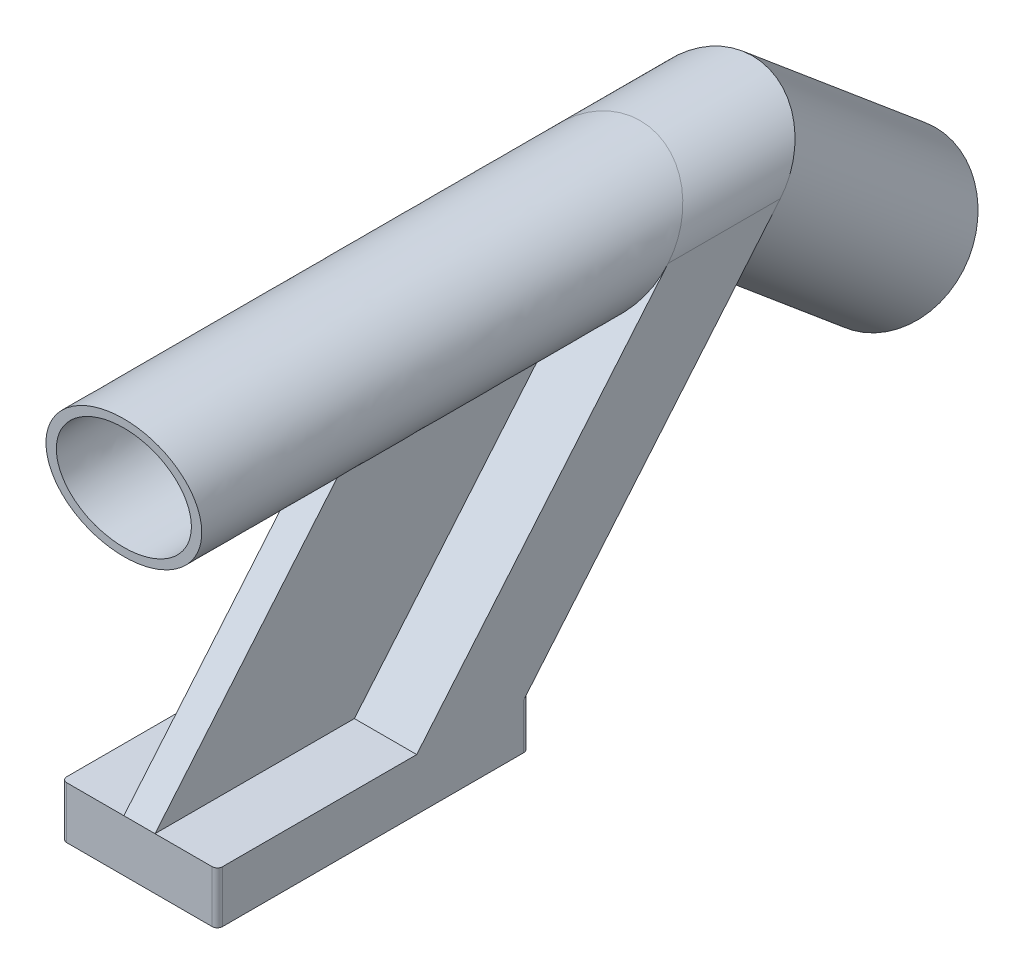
from build123d import *

# Parameters (mm, degrees)
SKIZZE1_W                       = 150
SKIZZE1_H                       = 300
AUFSATZ_LINEAR_AUSTRAGEN1_DEPTH = 50
AUFSATZ_LINEAR_AUSTRAGEN2_DEPTH = 108.045018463
SKIZZE5_R                       = 75
AUFSATZ_LINEAR_AUSTRAGEN5_DEPTH = 500
SKIZZE6_R                       = 65
SCHNITT_LINEAR_AUSTRAGEN1_DEPTH = 793.746399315
SKIZZE7_R                       = 75
AUFSATZ_LINEAR_AUSTRAGEN6_DEPTH = 230
SKIZZE8_R                       = 65
SCHNITT_LINEAR_AUSTRAGEN2_DEPTH = 230
VERST_RKUNGSRIPPE1_REACH        = 738.516
SKIZZE9_WALL_W                  = 1625.051576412
SKIZZE9_WALL_H                  = 30
VERRUNDUNG1_R                   = 5
VERRUNDUNG2_R                   = 5
SKIZZE11_W                      = 229.809265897
SKIZZE11_H                      = 231.414386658
SCHNITT_LINEAR_AUSTRAGEN3_DEPTH = 135


with BuildPart() as part:
    # Skizze1 → Aufsatz-Linear austragen1 (new body)
    with BuildSketch(Plane(origin=(0, 0, 0), x_dir=(1, 0, 0), z_dir=(0, 1, 0))):
        Rectangle(SKIZZE1_W, SKIZZE1_H)
    extrude(amount=AUFSATZ_LINEAR_AUSTRAGEN1_DEPTH)

    # Skizze2 → Aufsatz-Linear austragen2 (add, along a direction that is not the sketch's normal)
    with BuildSketch(Plane(origin=(0, 0, 0), x_dir=(1, 0, 0), z_dir=(0, 0.6427876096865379, 0.7660444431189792))):
        with BuildLine():
            Line((75, 0), (-75, 0))
            Line((-75, 0), (-75, 441.884080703))
            ThreePointArc((-75, 441.884080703), (0, 516.884080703), (75, 441.884080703))
            Line((75, 441.884080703), (75, 0))
        make_face()
    extrude(amount=-AUFSATZ_LINEAR_AUSTRAGEN2_DEPTH, dir=(0, 0, 1))

    # Skizze5 → Aufsatz-Linear austragen5 (add, along a direction that is not the sketch's normal)
    with BuildSketch(Plane(origin=(0, 0, 0), x_dir=(1, 0, 0), z_dir=(0, 0.6427876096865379, 0.7660444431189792))):
        with Locations((0, 441.884080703)):
            Circle(SKIZZE5_R)
    extrude(amount=AUFSATZ_LINEAR_AUSTRAGEN5_DEPTH, dir=(0, 0, 1))

    # Skizze6 → Schnitt-Linear austragen1 (cut, along a direction that is not the sketch's normal)
    with BuildSketch(Plane(origin=(0, 246.201938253, 293.412044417), x_dir=(1, 0, 0), z_dir=(0, 0.6427876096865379, 0.7660444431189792))):
        with Locations((0, 120.49027586)):
            Circle(SKIZZE6_R)
    extrude(amount=-SCHNITT_LINEAR_AUSTRAGEN1_DEPTH, dir=(0, 0, 1), mode=Mode.SUBTRACT)

    # Skizze7 → Aufsatz-Linear austragen6 (add)
    with BuildSketch(Plane(origin=(0, -53.201785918, -63.4034195), x_dir=(-1, 0, 0), z_dir=(0, -0.6427876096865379, -0.7660444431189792))):
        with Locations(Location((0, 511.334079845, 0), (0, 0, 180))):
            Circle(SKIZZE7_R)
    extrude(amount=AUFSATZ_LINEAR_AUSTRAGEN6_DEPTH)

    # Skizze8 → Schnitt-Linear austragen2 (cut)
    with BuildSketch(Plane(origin=(0, -201.042936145, -239.593641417), x_dir=(-1, 0, 0), z_dir=(0, -0.6427876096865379, -0.7660444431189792))):
        with Locations(Location((0, 511.334079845, 0), (0, 0, 90))):
            Circle(SKIZZE8_R)
    extrude(amount=-SCHNITT_LINEAR_AUSTRAGEN2_DEPTH, mode=Mode.SUBTRACT)

    # Skizze9 wall → Verst_rkungsrippe1 (add, up to next)
    with BuildSketch(Plane(origin=(0, 107.46060369, 101.784828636), x_dir=(0, 0.766044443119, -0.642787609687), z_dir=(0, 0.642787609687, 0.766044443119)), mode=Mode.PRIVATE) as verst_rkungsrippe1_sk1:
        Rectangle(SKIZZE9_WALL_W, SKIZZE9_WALL_H)
    verst_rkungsrippe1_tool1 = extrude(verst_rkungsrippe1_sk1.sketch, amount=-VERST_RKUNGSRIPPE1_REACH, mode=Mode.PRIVATE) - part.part
    add(verst_rkungsrippe1_tool1.solids().sort_by_distance((0, 107.46060369, 101.784828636))[0])

    # Verrundung1
    verrundung1_edges = [part.edges().sort_by_distance(p)[0] for p in [
        (75, 25, 150),
        (-75, 25, 150),
    ]]
    fillet(verrundung1_edges, radius=VERRUNDUNG1_R)

    # Verrundung2
    verrundung2_edges = [part.edges().sort_by_distance(p)[0] for p in [
        (-75, 25, -150),
        (75, 25, -150),
    ]]
    fillet(verrundung2_edges, radius=VERRUNDUNG2_R)

    # Skizze11 → Schnitt-Linear austragen3 (cut)
    with BuildSketch(Plane.XY.offset(300)):
        with Locations((-10.466503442, 330.47381303)):
            Rectangle(SKIZZE11_W, SKIZZE11_H)
    extrude(amount=-SCHNITT_LINEAR_AUSTRAGEN3_DEPTH, mode=Mode.SUBTRACT)


solid = part.part
